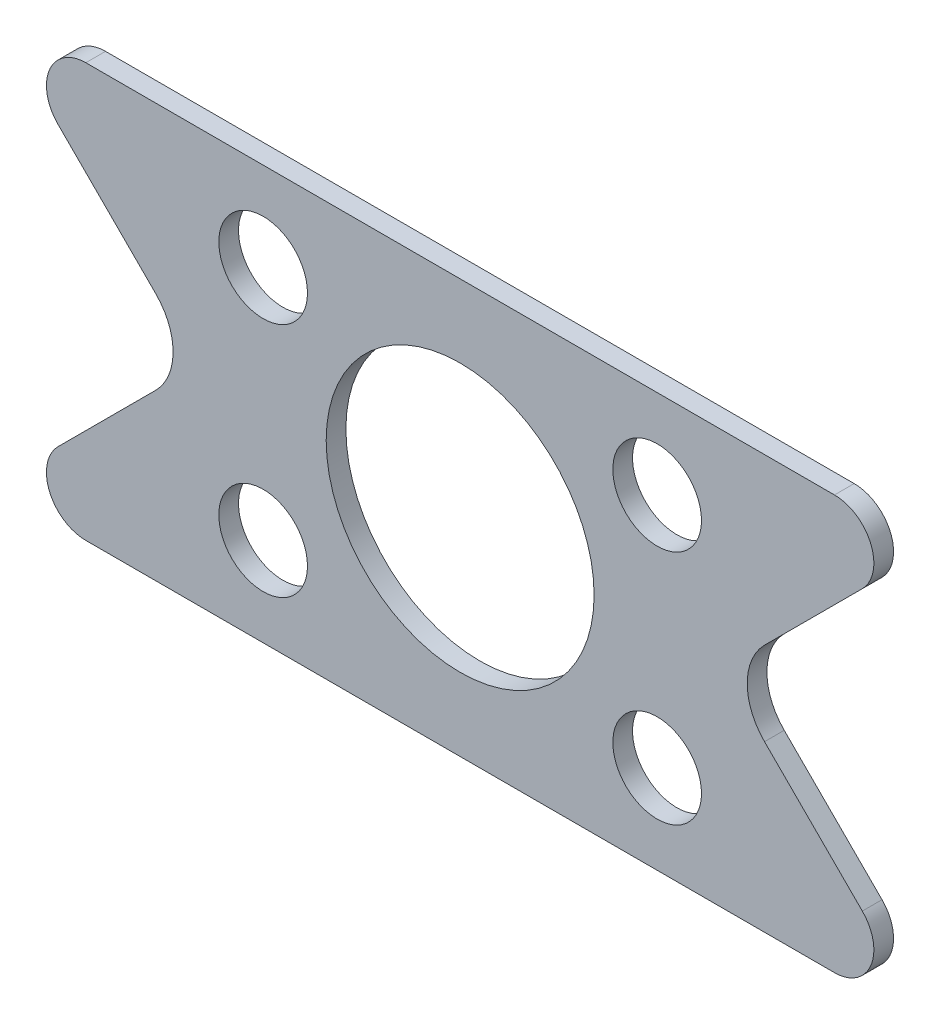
ISO-10303-21;
HEADER;
FILE_DESCRIPTION(('STEP AP214'),'2;1');
FILE_NAME('part.step','',(''),(''),'','','');
FILE_SCHEMA(('AUTOMOTIVE_DESIGN { 1 0 10303 214 1 1 1 1 }'));
ENDSEC;
DATA;
#1=APPLICATION_CONTEXT('core data for automotive mechanical design processes');
#2=APPLICATION_PROTOCOL_DEFINITION('international standard','automotive_design',2000,#1);
#3=PRODUCT_CONTEXT('',#1,'mechanical');
#4=PRODUCT('Part','Part','',(#3));
#5=PRODUCT_RELATED_PRODUCT_CATEGORY('part','',(#4));
#6=PRODUCT_DEFINITION_FORMATION('','',#4);
#7=PRODUCT_DEFINITION_CONTEXT('part definition',#1,'design');
#8=PRODUCT_DEFINITION('design','',#6,#7);
#9=PRODUCT_DEFINITION_SHAPE('','',#8);
#10=(LENGTH_UNIT() NAMED_UNIT(*) SI_UNIT(.MILLI.,.METRE.));
#11=(NAMED_UNIT(*) PLANE_ANGLE_UNIT() SI_UNIT($,.RADIAN.));
#12=(NAMED_UNIT(*) SI_UNIT($,.STERADIAN.) SOLID_ANGLE_UNIT());
#13=UNCERTAINTY_MEASURE_WITH_UNIT(LENGTH_MEASURE(1.E-05),#10,'distance_accuracy_value','');
#14=(GEOMETRIC_REPRESENTATION_CONTEXT(3) GLOBAL_UNCERTAINTY_ASSIGNED_CONTEXT((#13)) GLOBAL_UNIT_ASSIGNED_CONTEXT((#10,
#11,#12)) REPRESENTATION_CONTEXT('',''));
#15=CARTESIAN_POINT('',(0.,0.,0.));
#16=DIRECTION('',(0.,0.,1.));
#17=DIRECTION('',(1.,0.,0.));
#18=AXIS2_PLACEMENT_3D('',#15,#16,#17);
#19=CARTESIAN_POINT('',(-210.,-105.,10.));
#20=DIRECTION('',(0.,1.,0.));
#21=DIRECTION('',(0.,0.,1.));
#22=AXIS2_PLACEMENT_3D('',#19,#20,#21);
#23=PLANE('',#22);
#24=DIRECTION('',(0.,0.,1.));
#25=VECTOR('',#24,1.);
#26=CARTESIAN_POINT('',(-190.,-105.,0.));
#27=LINE('',#26,#25);
#28=CARTESIAN_POINT('',(-190.,-105.,0.));
#29=VERTEX_POINT('',#28);
#30=CARTESIAN_POINT('',(-190.,-105.,10.));
#31=VERTEX_POINT('',#30);
#32=EDGE_CURVE('E162',#29,#31,#27,.T.);
#33=ORIENTED_EDGE('',*,*,#32,.F.);
#34=DIRECTION('',(1.,0.,0.));
#35=VECTOR('',#34,1.);
#36=CARTESIAN_POINT('',(-210.,-105.,0.));
#37=LINE('',#36,#35);
#38=CARTESIAN_POINT('',(190.,-105.,0.));
#39=VERTEX_POINT('',#38);
#40=EDGE_CURVE('E145',#29,#39,#37,.T.);
#41=ORIENTED_EDGE('',*,*,#40,.T.);
#42=DIRECTION('',(0.,0.,1.));
#43=VECTOR('',#42,1.);
#44=CARTESIAN_POINT('',(190.,-105.,0.));
#45=LINE('',#44,#43);
#46=CARTESIAN_POINT('',(190.,-105.,10.));
#47=VERTEX_POINT('',#46);
#48=EDGE_CURVE('E185',#39,#47,#45,.T.);
#49=ORIENTED_EDGE('',*,*,#48,.T.);
#50=DIRECTION('',(1.,0.,0.));
#51=VECTOR('',#50,1.);
#52=CARTESIAN_POINT('',(-210.,-105.,10.));
#53=LINE('',#52,#51);
#54=EDGE_CURVE('E38',#31,#47,#53,.T.);
#55=ORIENTED_EDGE('',*,*,#54,.F.);
#56=EDGE_LOOP('',(#33,#41,#49,#55));
#57=FACE_BOUND('',#56,.T.);
#58=ADVANCED_FACE('F30',(#57),#23,.F.);
#59=CARTESIAN_POINT('',(-210.,-105.,10.));
#60=DIRECTION('',(0.,0.,-1.));
#61=DIRECTION('',(-1.,0.,0.));
#62=AXIS2_PLACEMENT_3D('',#59,#60,#61);
#63=PLANE('',#62);
#64=CARTESIAN_POINT('',(-100.,60.,10.));
#65=DIRECTION('',(0.,0.,1.));
#66=DIRECTION('',(1.,0.,0.));
#67=AXIS2_PLACEMENT_3D('',#64,#65,#66);
#68=CIRCLE('',#67,22.5);
#69=CARTESIAN_POINT('',(-77.5,60.,10.));
#70=VERTEX_POINT('',#69);
#71=EDGE_CURVE('E213',#70,#70,#68,.T.);
#72=ORIENTED_EDGE('',*,*,#71,.F.);
#73=EDGE_LOOP('',(#72));
#74=FACE_BOUND('',#73,.T.);
#75=CARTESIAN_POINT('',(100.,-60.,10.));
#76=DIRECTION('',(0.,0.,1.));
#77=DIRECTION('',(1.,0.,0.));
#78=AXIS2_PLACEMENT_3D('',#75,#76,#77);
#79=CIRCLE('',#78,22.5);
#80=CARTESIAN_POINT('',(122.5,-60.,10.));
#81=VERTEX_POINT('',#80);
#82=EDGE_CURVE('E225',#81,#81,#79,.T.);
#83=ORIENTED_EDGE('',*,*,#82,.F.);
#84=EDGE_LOOP('',(#83));
#85=FACE_BOUND('',#84,.T.);
#86=CARTESIAN_POINT('',(0.,0.,10.));
#87=DIRECTION('',(0.,0.,1.));
#88=DIRECTION('',(1.,0.,0.));
#89=AXIS2_PLACEMENT_3D('',#86,#87,#88);
#90=CIRCLE('',#89,68.);
#91=CARTESIAN_POINT('',(68.,0.,10.));
#92=VERTEX_POINT('',#91);
#93=EDGE_CURVE('E237',#92,#92,#90,.T.);
#94=ORIENTED_EDGE('',*,*,#93,.F.);
#95=EDGE_LOOP('',(#94));
#96=FACE_BOUND('',#95,.T.);
#97=CARTESIAN_POINT('',(100.,60.,10.));
#98=DIRECTION('',(0.,0.,1.));
#99=DIRECTION('',(1.,0.,0.));
#100=AXIS2_PLACEMENT_3D('',#97,#98,#99);
#101=CIRCLE('',#100,22.5);
#102=CARTESIAN_POINT('',(122.5,60.,10.));
#103=VERTEX_POINT('',#102);
#104=EDGE_CURVE('E231',#103,#103,#101,.T.);
#105=ORIENTED_EDGE('',*,*,#104,.F.);
#106=EDGE_LOOP('',(#105));
#107=FACE_BOUND('',#106,.T.);
#108=CARTESIAN_POINT('',(-100.,-60.,10.));
#109=DIRECTION('',(0.,0.,1.));
#110=DIRECTION('',(1.,0.,0.));
#111=AXIS2_PLACEMENT_3D('',#108,#109,#110);
#112=CIRCLE('',#111,22.5);
#113=CARTESIAN_POINT('',(-77.5,-60.,10.));
#114=VERTEX_POINT('',#113);
#115=EDGE_CURVE('E219',#114,#114,#112,.T.);
#116=ORIENTED_EDGE('',*,*,#115,.F.);
#117=EDGE_LOOP('',(#116));
#118=FACE_BOUND('',#117,.T.);
#119=CARTESIAN_POINT('',(-190.,-85.,10.));
#120=DIRECTION('',(0.,0.,1.));
#121=DIRECTION('',(-1.,0.,0.));
#122=AXIS2_PLACEMENT_3D('',#119,#120,#121);
#123=CIRCLE('',#122,19.9999999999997);
#124=CARTESIAN_POINT('',(-204.142135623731,-70.8578643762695,10.));
#125=VERTEX_POINT('',#124);
#126=EDGE_CURVE('E138',#125,#31,#123,.T.);
#127=ORIENTED_EDGE('',*,*,#126,.T.);
#128=ORIENTED_EDGE('',*,*,#54,.T.);
#129=CARTESIAN_POINT('',(190.,-85.,10.));
#130=DIRECTION('',(0.,0.,-1.));
#131=DIRECTION('',(1.,0.,0.));
#132=AXIS2_PLACEMENT_3D('',#129,#130,#131);
#133=CIRCLE('',#132,19.9999999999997);
#134=CARTESIAN_POINT('',(204.142135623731,-70.8578643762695,10.));
#135=VERTEX_POINT('',#134);
#136=EDGE_CURVE('E164',#135,#47,#133,.T.);
#137=ORIENTED_EDGE('',*,*,#136,.F.);
#138=DIRECTION('',(0.707106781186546,-0.707106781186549,0.));
#139=VECTOR('',#138,1.);
#140=CARTESIAN_POINT('',(154.497474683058,-21.2132034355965,10.));
#141=LINE('',#140,#139);
#142=CARTESIAN_POINT('',(154.497474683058,-21.2132034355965,10.));
#143=VERTEX_POINT('',#142);
#144=EDGE_CURVE('E174',#143,#135,#141,.T.);
#145=ORIENTED_EDGE('',*,*,#144,.F.);
#146=CARTESIAN_POINT('',(175.710678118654,-1.43218770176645E-13,10.));
#147=DIRECTION('',(0.,0.,1.));
#148=DIRECTION('',(1.,0.,0.));
#149=AXIS2_PLACEMENT_3D('',#146,#147,#148);
#150=CIRCLE('',#149,30.);
#151=CARTESIAN_POINT('',(154.497474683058,21.2132034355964,10.));
#152=VERTEX_POINT('',#151);
#153=EDGE_CURVE('E193',#152,#143,#150,.T.);
#154=ORIENTED_EDGE('',*,*,#153,.F.);
#155=DIRECTION('',(-0.707106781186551,-0.707106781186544,0.));
#156=VECTOR('',#155,1.);
#157=CARTESIAN_POINT('',(204.142135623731,70.8578643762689,10.));
#158=LINE('',#157,#156);
#159=CARTESIAN_POINT('',(204.142135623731,70.8578643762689,10.));
#160=VERTEX_POINT('',#159);
#161=EDGE_CURVE('E190',#160,#152,#158,.T.);
#162=ORIENTED_EDGE('',*,*,#161,.F.);
#163=CARTESIAN_POINT('',(190.,85.,10.));
#164=DIRECTION('',(0.,0.,-1.));
#165=DIRECTION('',(1.,0.,0.));
#166=AXIS2_PLACEMENT_3D('',#163,#164,#165);
#167=CIRCLE('',#166,20.);
#168=CARTESIAN_POINT('',(190.,105.,10.));
#169=VERTEX_POINT('',#168);
#170=EDGE_CURVE('E188',#169,#160,#167,.T.);
#171=ORIENTED_EDGE('',*,*,#170,.F.);
#172=DIRECTION('',(-1.,0.,0.));
#173=VECTOR('',#172,1.);
#174=CARTESIAN_POINT('',(-210.,105.,10.));
#175=LINE('',#174,#173);
#176=CARTESIAN_POINT('',(-190.,105.,10.));
#177=VERTEX_POINT('',#176);
#178=EDGE_CURVE('E11',#169,#177,#175,.T.);
#179=ORIENTED_EDGE('',*,*,#178,.T.);
#180=CARTESIAN_POINT('',(-190.,85.,10.));
#181=DIRECTION('',(0.,0.,1.));
#182=DIRECTION('',(-1.,0.,0.));
#183=AXIS2_PLACEMENT_3D('',#180,#181,#182);
#184=CIRCLE('',#183,20.);
#185=CARTESIAN_POINT('',(-204.142135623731,70.8578643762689,10.));
#186=VERTEX_POINT('',#185);
#187=EDGE_CURVE('E46',#177,#186,#184,.T.);
#188=ORIENTED_EDGE('',*,*,#187,.T.);
#189=DIRECTION('',(0.707106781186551,-0.707106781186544,0.));
#190=VECTOR('',#189,1.);
#191=CARTESIAN_POINT('',(-204.142135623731,70.8578643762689,10.));
#192=LINE('',#191,#190);
#193=CARTESIAN_POINT('',(-154.497474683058,21.2132034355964,10.));
#194=VERTEX_POINT('',#193);
#195=EDGE_CURVE('E147',#186,#194,#192,.T.);
#196=ORIENTED_EDGE('',*,*,#195,.T.);
#197=CARTESIAN_POINT('',(-175.710678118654,-1.43218770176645E-13,10.));
#198=DIRECTION('',(0.,0.,-1.));
#199=DIRECTION('',(-1.,0.,0.));
#200=AXIS2_PLACEMENT_3D('',#197,#198,#199);
#201=CIRCLE('',#200,30.);
#202=CARTESIAN_POINT('',(-154.497474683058,-21.2132034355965,10.));
#203=VERTEX_POINT('',#202);
#204=EDGE_CURVE('E157',#194,#203,#201,.T.);
#205=ORIENTED_EDGE('',*,*,#204,.T.);
#206=DIRECTION('',(-0.707106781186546,-0.707106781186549,0.));
#207=VECTOR('',#206,1.);
#208=CARTESIAN_POINT('',(-154.497474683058,-21.2132034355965,10.));
#209=LINE('',#208,#207);
#210=EDGE_CURVE('E155',#203,#125,#209,.T.);
#211=ORIENTED_EDGE('',*,*,#210,.T.);
#212=EDGE_LOOP('',(#127,#128,#137,#145,#154,#162,#171,#179,#188,#196,#205,#211));
#213=FACE_BOUND('',#212,.T.);
#214=ADVANCED_FACE('F259',(#74,#85,#96,#107,#118,#213),#63,.F.);
#215=CARTESIAN_POINT('',(-210.,-105.,0.));
#216=DIRECTION('',(0.,0.,-1.));
#217=DIRECTION('',(-1.,0.,0.));
#218=AXIS2_PLACEMENT_3D('',#215,#216,#217);
#219=PLANE('',#218);
#220=CARTESIAN_POINT('',(-100.,60.,0.));
#221=DIRECTION('',(0.,0.,1.));
#222=DIRECTION('',(1.,0.,0.));
#223=AXIS2_PLACEMENT_3D('',#220,#221,#222);
#224=CIRCLE('',#223,22.5);
#225=CARTESIAN_POINT('',(-77.5,60.,0.));
#226=VERTEX_POINT('',#225);
#227=EDGE_CURVE('E201',#226,#226,#224,.T.);
#228=ORIENTED_EDGE('',*,*,#227,.T.);
#229=EDGE_LOOP('',(#228));
#230=FACE_BOUND('',#229,.T.);
#231=CARTESIAN_POINT('',(100.,-60.,0.));
#232=DIRECTION('',(0.,0.,1.));
#233=DIRECTION('',(1.,0.,0.));
#234=AXIS2_PLACEMENT_3D('',#231,#232,#233);
#235=CIRCLE('',#234,22.5);
#236=CARTESIAN_POINT('',(122.5,-60.,0.));
#237=VERTEX_POINT('',#236);
#238=EDGE_CURVE('E222',#237,#237,#235,.T.);
#239=ORIENTED_EDGE('',*,*,#238,.T.);
#240=EDGE_LOOP('',(#239));
#241=FACE_BOUND('',#240,.T.);
#242=CARTESIAN_POINT('',(0.,0.,0.));
#243=DIRECTION('',(0.,0.,1.));
#244=DIRECTION('',(1.,0.,0.));
#245=AXIS2_PLACEMENT_3D('',#242,#243,#244);
#246=CIRCLE('',#245,68.);
#247=CARTESIAN_POINT('',(68.,0.,0.));
#248=VERTEX_POINT('',#247);
#249=EDGE_CURVE('E234',#248,#248,#246,.T.);
#250=ORIENTED_EDGE('',*,*,#249,.T.);
#251=EDGE_LOOP('',(#250));
#252=FACE_BOUND('',#251,.T.);
#253=CARTESIAN_POINT('',(100.,60.,0.));
#254=DIRECTION('',(0.,0.,1.));
#255=DIRECTION('',(1.,0.,0.));
#256=AXIS2_PLACEMENT_3D('',#253,#254,#255);
#257=CIRCLE('',#256,22.5);
#258=CARTESIAN_POINT('',(122.5,60.,0.));
#259=VERTEX_POINT('',#258);
#260=EDGE_CURVE('E228',#259,#259,#257,.T.);
#261=ORIENTED_EDGE('',*,*,#260,.T.);
#262=EDGE_LOOP('',(#261));
#263=FACE_BOUND('',#262,.T.);
#264=CARTESIAN_POINT('',(-100.,-60.,0.));
#265=DIRECTION('',(0.,0.,1.));
#266=DIRECTION('',(1.,0.,0.));
#267=AXIS2_PLACEMENT_3D('',#264,#265,#266);
#268=CIRCLE('',#267,22.5);
#269=CARTESIAN_POINT('',(-77.5,-60.,0.));
#270=VERTEX_POINT('',#269);
#271=EDGE_CURVE('E216',#270,#270,#268,.T.);
#272=ORIENTED_EDGE('',*,*,#271,.T.);
#273=EDGE_LOOP('',(#272));
#274=FACE_BOUND('',#273,.T.);
#275=ORIENTED_EDGE('',*,*,#40,.F.);
#276=CARTESIAN_POINT('',(-190.,-85.,0.));
#277=DIRECTION('',(0.,0.,1.));
#278=DIRECTION('',(-1.,0.,0.));
#279=AXIS2_PLACEMENT_3D('',#276,#277,#278);
#280=CIRCLE('',#279,19.9999999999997);
#281=CARTESIAN_POINT('',(-204.142135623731,-70.8578643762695,0.));
#282=VERTEX_POINT('',#281);
#283=EDGE_CURVE('E132',#282,#29,#280,.T.);
#284=ORIENTED_EDGE('',*,*,#283,.F.);
#285=DIRECTION('',(-0.707106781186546,-0.707106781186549,0.));
#286=VECTOR('',#285,1.);
#287=CARTESIAN_POINT('',(-154.497474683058,-21.2132034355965,0.));
#288=LINE('',#287,#286);
#289=CARTESIAN_POINT('',(-154.497474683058,-21.2132034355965,0.));
#290=VERTEX_POINT('',#289);
#291=EDGE_CURVE('E121',#290,#282,#288,.T.);
#292=ORIENTED_EDGE('',*,*,#291,.F.);
#293=CARTESIAN_POINT('',(-175.710678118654,-1.43218770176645E-13,0.));
#294=DIRECTION('',(0.,0.,-1.));
#295=DIRECTION('',(-1.,0.,0.));
#296=AXIS2_PLACEMENT_3D('',#293,#294,#295);
#297=CIRCLE('',#296,30.);
#298=CARTESIAN_POINT('',(-154.497474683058,21.2132034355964,0.));
#299=VERTEX_POINT('',#298);
#300=EDGE_CURVE('E131',#299,#290,#297,.T.);
#301=ORIENTED_EDGE('',*,*,#300,.F.);
#302=DIRECTION('',(0.707106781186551,-0.707106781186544,0.));
#303=VECTOR('',#302,1.);
#304=CARTESIAN_POINT('',(-204.142135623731,70.8578643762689,0.));
#305=LINE('',#304,#303);
#306=CARTESIAN_POINT('',(-204.142135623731,70.8578643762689,0.));
#307=VERTEX_POINT('',#306);
#308=EDGE_CURVE('E151',#307,#299,#305,.T.);
#309=ORIENTED_EDGE('',*,*,#308,.F.);
#310=CARTESIAN_POINT('',(-190.,85.,0.));
#311=DIRECTION('',(0.,0.,1.));
#312=DIRECTION('',(-1.,0.,0.));
#313=AXIS2_PLACEMENT_3D('',#310,#311,#312);
#314=CIRCLE('',#313,20.);
#315=CARTESIAN_POINT('',(-190.,105.,0.));
#316=VERTEX_POINT('',#315);
#317=EDGE_CURVE('E140',#316,#307,#314,.T.);
#318=ORIENTED_EDGE('',*,*,#317,.F.);
#319=DIRECTION('',(-1.,0.,0.));
#320=VECTOR('',#319,1.);
#321=CARTESIAN_POINT('',(-210.,105.,0.));
#322=LINE('',#321,#320);
#323=CARTESIAN_POINT('',(190.,105.,0.));
#324=VERTEX_POINT('',#323);
#325=EDGE_CURVE('E33',#324,#316,#322,.T.);
#326=ORIENTED_EDGE('',*,*,#325,.F.);
#327=CARTESIAN_POINT('',(190.,85.,0.));
#328=DIRECTION('',(0.,0.,-1.));
#329=DIRECTION('',(1.,0.,0.));
#330=AXIS2_PLACEMENT_3D('',#327,#328,#329);
#331=CIRCLE('',#330,20.);
#332=CARTESIAN_POINT('',(204.142135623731,70.8578643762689,0.));
#333=VERTEX_POINT('',#332);
#334=EDGE_CURVE('E54',#324,#333,#331,.T.);
#335=ORIENTED_EDGE('',*,*,#334,.T.);
#336=DIRECTION('',(-0.707106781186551,-0.707106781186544,0.));
#337=VECTOR('',#336,1.);
#338=CARTESIAN_POINT('',(204.142135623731,70.8578643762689,0.));
#339=LINE('',#338,#337);
#340=CARTESIAN_POINT('',(154.497474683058,21.2132034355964,0.));
#341=VERTEX_POINT('',#340);
#342=EDGE_CURVE('E176',#333,#341,#339,.T.);
#343=ORIENTED_EDGE('',*,*,#342,.T.);
#344=CARTESIAN_POINT('',(175.710678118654,-1.43218770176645E-13,0.));
#345=DIRECTION('',(0.,0.,1.));
#346=DIRECTION('',(1.,0.,0.));
#347=AXIS2_PLACEMENT_3D('',#344,#345,#346);
#348=CIRCLE('',#347,30.);
#349=CARTESIAN_POINT('',(154.497474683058,-21.2132034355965,0.));
#350=VERTEX_POINT('',#349);
#351=EDGE_CURVE('E179',#341,#350,#348,.T.);
#352=ORIENTED_EDGE('',*,*,#351,.T.);
#353=DIRECTION('',(0.707106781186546,-0.707106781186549,0.));
#354=VECTOR('',#353,1.);
#355=CARTESIAN_POINT('',(154.497474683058,-21.2132034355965,0.));
#356=LINE('',#355,#354);
#357=CARTESIAN_POINT('',(204.142135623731,-70.8578643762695,0.));
#358=VERTEX_POINT('',#357);
#359=EDGE_CURVE('E182',#350,#358,#356,.T.);
#360=ORIENTED_EDGE('',*,*,#359,.T.);
#361=CARTESIAN_POINT('',(190.,-85.,0.));
#362=DIRECTION('',(0.,0.,-1.));
#363=DIRECTION('',(1.,0.,0.));
#364=AXIS2_PLACEMENT_3D('',#361,#362,#363);
#365=CIRCLE('',#364,19.9999999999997);
#366=EDGE_CURVE('E172',#358,#39,#365,.T.);
#367=ORIENTED_EDGE('',*,*,#366,.T.);
#368=EDGE_LOOP('',(#275,#284,#292,#301,#309,#318,#326,#335,#343,#352,#360,#367));
#369=FACE_BOUND('',#368,.T.);
#370=ADVANCED_FACE('F143',(#230,#241,#252,#263,#274,#369),#219,.T.);
#371=CARTESIAN_POINT('',(-210.,105.,10.));
#372=DIRECTION('',(0.,-1.,0.));
#373=DIRECTION('',(1.,0.,0.));
#374=AXIS2_PLACEMENT_3D('',#371,#372,#373);
#375=PLANE('',#374);
#376=ORIENTED_EDGE('',*,*,#325,.T.);
#377=DIRECTION('',(0.,0.,1.));
#378=VECTOR('',#377,1.);
#379=CARTESIAN_POINT('',(-190.,105.,0.));
#380=LINE('',#379,#378);
#381=EDGE_CURVE('E165',#316,#177,#380,.T.);
#382=ORIENTED_EDGE('',*,*,#381,.T.);
#383=ORIENTED_EDGE('',*,*,#178,.F.);
#384=DIRECTION('',(0.,0.,1.));
#385=VECTOR('',#384,1.);
#386=CARTESIAN_POINT('',(190.,105.,0.));
#387=LINE('',#386,#385);
#388=EDGE_CURVE('E209',#324,#169,#387,.T.);
#389=ORIENTED_EDGE('',*,*,#388,.F.);
#390=EDGE_LOOP('',(#376,#382,#383,#389));
#391=FACE_BOUND('',#390,.T.);
#392=ADVANCED_FACE('F247',(#391),#375,.F.);
#393=CARTESIAN_POINT('',(0.,0.,10.));
#394=DIRECTION('',(0.,0.,-1.));
#395=DIRECTION('',(-1.,0.,0.));
#396=AXIS2_PLACEMENT_3D('',#393,#394,#395);
#397=CYLINDRICAL_SURFACE('',#396,68.);
#398=ORIENTED_EDGE('',*,*,#93,.T.);
#399=EDGE_LOOP('',(#398));
#400=FACE_BOUND('',#399,.T.);
#401=ORIENTED_EDGE('',*,*,#249,.F.);
#402=EDGE_LOOP('',(#401));
#403=FACE_BOUND('',#402,.T.);
#404=ADVANCED_FACE('F414',(#400,#403),#397,.F.);
#405=CARTESIAN_POINT('',(100.,60.,10.));
#406=DIRECTION('',(0.,0.,-1.));
#407=DIRECTION('',(-1.,0.,0.));
#408=AXIS2_PLACEMENT_3D('',#405,#406,#407);
#409=CYLINDRICAL_SURFACE('',#408,22.5);
#410=ORIENTED_EDGE('',*,*,#104,.T.);
#411=EDGE_LOOP('',(#410));
#412=FACE_BOUND('',#411,.T.);
#413=ORIENTED_EDGE('',*,*,#260,.F.);
#414=EDGE_LOOP('',(#413));
#415=FACE_BOUND('',#414,.T.);
#416=ADVANCED_FACE('F405',(#412,#415),#409,.F.);
#417=CARTESIAN_POINT('',(100.,-60.,10.));
#418=DIRECTION('',(0.,0.,-1.));
#419=DIRECTION('',(-1.,0.,0.));
#420=AXIS2_PLACEMENT_3D('',#417,#418,#419);
#421=CYLINDRICAL_SURFACE('',#420,22.5);
#422=ORIENTED_EDGE('',*,*,#82,.T.);
#423=EDGE_LOOP('',(#422));
#424=FACE_BOUND('',#423,.T.);
#425=ORIENTED_EDGE('',*,*,#238,.F.);
#426=EDGE_LOOP('',(#425));
#427=FACE_BOUND('',#426,.T.);
#428=ADVANCED_FACE('F396',(#424,#427),#421,.F.);
#429=CARTESIAN_POINT('',(-100.,-60.,10.));
#430=DIRECTION('',(0.,0.,-1.));
#431=DIRECTION('',(-1.,0.,0.));
#432=AXIS2_PLACEMENT_3D('',#429,#430,#431);
#433=CYLINDRICAL_SURFACE('',#432,22.5);
#434=ORIENTED_EDGE('',*,*,#115,.T.);
#435=EDGE_LOOP('',(#434));
#436=FACE_BOUND('',#435,.T.);
#437=ORIENTED_EDGE('',*,*,#271,.F.);
#438=EDGE_LOOP('',(#437));
#439=FACE_BOUND('',#438,.T.);
#440=ADVANCED_FACE('F387',(#436,#439),#433,.F.);
#441=CARTESIAN_POINT('',(-100.,60.,10.));
#442=DIRECTION('',(0.,0.,-1.));
#443=DIRECTION('',(-1.,0.,0.));
#444=AXIS2_PLACEMENT_3D('',#441,#442,#443);
#445=CYLINDRICAL_SURFACE('',#444,22.5);
#446=ORIENTED_EDGE('',*,*,#71,.T.);
#447=EDGE_LOOP('',(#446));
#448=FACE_BOUND('',#447,.T.);
#449=ORIENTED_EDGE('',*,*,#227,.F.);
#450=EDGE_LOOP('',(#449));
#451=FACE_BOUND('',#450,.T.);
#452=ADVANCED_FACE('F274',(#448,#451),#445,.F.);
#453=CARTESIAN_POINT('',(190.,-85.,0.));
#454=DIRECTION('',(0.,0.,1.));
#455=DIRECTION('',(1.,0.,0.));
#456=AXIS2_PLACEMENT_3D('',#453,#454,#455);
#457=CYLINDRICAL_SURFACE('',#456,19.9999999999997);
#458=ORIENTED_EDGE('',*,*,#136,.T.);
#459=ORIENTED_EDGE('',*,*,#48,.F.);
#460=ORIENTED_EDGE('',*,*,#366,.F.);
#461=DIRECTION('',(0.,0.,1.));
#462=VECTOR('',#461,1.);
#463=CARTESIAN_POINT('',(204.142135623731,-70.8578643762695,0.));
#464=LINE('',#463,#462);
#465=EDGE_CURVE('E198',#358,#135,#464,.T.);
#466=ORIENTED_EDGE('',*,*,#465,.T.);
#467=EDGE_LOOP('',(#458,#459,#460,#466));
#468=FACE_BOUND('',#467,.T.);
#469=ADVANCED_FACE('F265',(#468),#457,.T.);
#470=CARTESIAN_POINT('',(190.,85.,0.));
#471=DIRECTION('',(0.,0.,1.));
#472=DIRECTION('',(1.,0.,0.));
#473=AXIS2_PLACEMENT_3D('',#470,#471,#472);
#474=CYLINDRICAL_SURFACE('',#473,20.);
#475=ORIENTED_EDGE('',*,*,#170,.T.);
#476=DIRECTION('',(0.,0.,1.));
#477=VECTOR('',#476,1.);
#478=CARTESIAN_POINT('',(204.142135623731,70.8578643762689,0.));
#479=LINE('',#478,#477);
#480=EDGE_CURVE('E206',#333,#160,#479,.T.);
#481=ORIENTED_EDGE('',*,*,#480,.F.);
#482=ORIENTED_EDGE('',*,*,#334,.F.);
#483=ORIENTED_EDGE('',*,*,#388,.T.);
#484=EDGE_LOOP('',(#475,#481,#482,#483));
#485=FACE_BOUND('',#484,.T.);
#486=ADVANCED_FACE('F262',(#485),#474,.T.);
#487=CARTESIAN_POINT('',(154.497474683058,-21.2132034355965,0.));
#488=DIRECTION('',(-0.707106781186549,-0.707106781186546,0.));
#489=DIRECTION('',(0.707106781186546,-0.707106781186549,0.));
#490=AXIS2_PLACEMENT_3D('',#487,#488,#489);
#491=PLANE('',#490);
#492=ORIENTED_EDGE('',*,*,#144,.T.);
#493=ORIENTED_EDGE('',*,*,#465,.F.);
#494=ORIENTED_EDGE('',*,*,#359,.F.);
#495=DIRECTION('',(0.,0.,1.));
#496=VECTOR('',#495,1.);
#497=CARTESIAN_POINT('',(154.497474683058,-21.2132034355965,0.));
#498=LINE('',#497,#496);
#499=EDGE_CURVE('E202',#350,#143,#498,.T.);
#500=ORIENTED_EDGE('',*,*,#499,.T.);
#501=EDGE_LOOP('',(#492,#493,#494,#500));
#502=FACE_BOUND('',#501,.T.);
#503=ADVANCED_FACE('F264',(#502),#491,.F.);
#504=CARTESIAN_POINT('',(175.710678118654,-1.43218770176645E-13,0.));
#505=DIRECTION('',(0.,0.,1.));
#506=DIRECTION('',(1.,0.,0.));
#507=AXIS2_PLACEMENT_3D('',#504,#505,#506);
#508=CYLINDRICAL_SURFACE('',#507,30.);
#509=ORIENTED_EDGE('',*,*,#153,.T.);
#510=ORIENTED_EDGE('',*,*,#499,.F.);
#511=ORIENTED_EDGE('',*,*,#351,.F.);
#512=DIRECTION('',(0.,0.,1.));
#513=VECTOR('',#512,1.);
#514=CARTESIAN_POINT('',(154.497474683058,21.2132034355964,0.));
#515=LINE('',#514,#513);
#516=EDGE_CURVE('E204',#341,#152,#515,.T.);
#517=ORIENTED_EDGE('',*,*,#516,.T.);
#518=EDGE_LOOP('',(#509,#510,#511,#517));
#519=FACE_BOUND('',#518,.T.);
#520=ADVANCED_FACE('F271',(#519),#508,.F.);
#521=CARTESIAN_POINT('',(204.142135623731,70.8578643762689,0.));
#522=DIRECTION('',(-0.707106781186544,0.707106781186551,0.));
#523=DIRECTION('',(-0.707106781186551,-0.707106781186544,0.));
#524=AXIS2_PLACEMENT_3D('',#521,#522,#523);
#525=PLANE('',#524);
#526=ORIENTED_EDGE('',*,*,#161,.T.);
#527=ORIENTED_EDGE('',*,*,#516,.F.);
#528=ORIENTED_EDGE('',*,*,#342,.F.);
#529=ORIENTED_EDGE('',*,*,#480,.T.);
#530=EDGE_LOOP('',(#526,#527,#528,#529));
#531=FACE_BOUND('',#530,.T.);
#532=ADVANCED_FACE('F292',(#531),#525,.F.);
#533=CARTESIAN_POINT('',(-190.,-85.,0.));
#534=DIRECTION('',(0.,0.,1.));
#535=DIRECTION('',(1.,0.,0.));
#536=AXIS2_PLACEMENT_3D('',#533,#534,#535);
#537=CYLINDRICAL_SURFACE('',#536,19.9999999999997);
#538=ORIENTED_EDGE('',*,*,#283,.T.);
#539=ORIENTED_EDGE('',*,*,#32,.T.);
#540=ORIENTED_EDGE('',*,*,#126,.F.);
#541=DIRECTION('',(0.,0.,1.));
#542=VECTOR('',#541,1.);
#543=CARTESIAN_POINT('',(-204.142135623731,-70.8578643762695,0.));
#544=LINE('',#543,#542);
#545=EDGE_CURVE('E125',#282,#125,#544,.T.);
#546=ORIENTED_EDGE('',*,*,#545,.F.);
#547=EDGE_LOOP('',(#538,#539,#540,#546));
#548=FACE_BOUND('',#547,.T.);
#549=ADVANCED_FACE('F135',(#548),#537,.T.);
#550=CARTESIAN_POINT('',(-190.,85.,0.));
#551=DIRECTION('',(0.,0.,1.));
#552=DIRECTION('',(1.,0.,0.));
#553=AXIS2_PLACEMENT_3D('',#550,#551,#552);
#554=CYLINDRICAL_SURFACE('',#553,20.);
#555=ORIENTED_EDGE('',*,*,#317,.T.);
#556=DIRECTION('',(0.,0.,1.));
#557=VECTOR('',#556,1.);
#558=CARTESIAN_POINT('',(-204.142135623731,70.8578643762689,0.));
#559=LINE('',#558,#557);
#560=EDGE_CURVE('E167',#307,#186,#559,.T.);
#561=ORIENTED_EDGE('',*,*,#560,.T.);
#562=ORIENTED_EDGE('',*,*,#187,.F.);
#563=ORIENTED_EDGE('',*,*,#381,.F.);
#564=EDGE_LOOP('',(#555,#561,#562,#563));
#565=FACE_BOUND('',#564,.T.);
#566=ADVANCED_FACE('F252',(#565),#554,.T.);
#567=CARTESIAN_POINT('',(-204.142135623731,70.8578643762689,0.));
#568=DIRECTION('',(-0.707106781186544,-0.707106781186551,0.));
#569=DIRECTION('',(0.707106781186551,-0.707106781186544,0.));
#570=AXIS2_PLACEMENT_3D('',#567,#568,#569);
#571=PLANE('',#570);
#572=ORIENTED_EDGE('',*,*,#195,.F.);
#573=ORIENTED_EDGE('',*,*,#560,.F.);
#574=ORIENTED_EDGE('',*,*,#308,.T.);
#575=DIRECTION('',(0.,0.,1.));
#576=VECTOR('',#575,1.);
#577=CARTESIAN_POINT('',(-154.497474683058,21.2132034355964,0.));
#578=LINE('',#577,#576);
#579=EDGE_CURVE('E169',#299,#194,#578,.T.);
#580=ORIENTED_EDGE('',*,*,#579,.T.);
#581=EDGE_LOOP('',(#572,#573,#574,#580));
#582=FACE_BOUND('',#581,.T.);
#583=ADVANCED_FACE('F255',(#582),#571,.T.);
#584=CARTESIAN_POINT('',(-175.710678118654,-1.43218770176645E-13,0.));
#585=DIRECTION('',(0.,0.,1.));
#586=DIRECTION('',(1.,0.,0.));
#587=AXIS2_PLACEMENT_3D('',#584,#585,#586);
#588=CYLINDRICAL_SURFACE('',#587,30.);
#589=ORIENTED_EDGE('',*,*,#204,.F.);
#590=ORIENTED_EDGE('',*,*,#579,.F.);
#591=ORIENTED_EDGE('',*,*,#300,.T.);
#592=DIRECTION('',(0.,0.,1.));
#593=VECTOR('',#592,1.);
#594=CARTESIAN_POINT('',(-154.497474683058,-21.2132034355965,0.));
#595=LINE('',#594,#593);
#596=EDGE_CURVE('E127',#290,#203,#595,.T.);
#597=ORIENTED_EDGE('',*,*,#596,.T.);
#598=EDGE_LOOP('',(#589,#590,#591,#597));
#599=FACE_BOUND('',#598,.T.);
#600=ADVANCED_FACE('F303',(#599),#588,.F.);
#601=CARTESIAN_POINT('',(-154.497474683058,-21.2132034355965,0.));
#602=DIRECTION('',(-0.707106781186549,0.707106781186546,0.));
#603=DIRECTION('',(-0.707106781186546,-0.707106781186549,0.));
#604=AXIS2_PLACEMENT_3D('',#601,#602,#603);
#605=PLANE('',#604);
#606=ORIENTED_EDGE('',*,*,#210,.F.);
#607=ORIENTED_EDGE('',*,*,#596,.F.);
#608=ORIENTED_EDGE('',*,*,#291,.T.);
#609=ORIENTED_EDGE('',*,*,#545,.T.);
#610=EDGE_LOOP('',(#606,#607,#608,#609));
#611=FACE_BOUND('',#610,.T.);
#612=ADVANCED_FACE('F124',(#611),#605,.T.);
#613=CLOSED_SHELL('',(#58,#214,#370,#392,#404,#416,#428,#440,#452,#469,#486,#503,#520,#532,#549,
#566,#583,#600,#612));
#614=MANIFOLD_SOLID_BREP('B2',#613);
#615=ADVANCED_BREP_SHAPE_REPRESENTATION('',(#18,#614),#14);
#616=SHAPE_DEFINITION_REPRESENTATION(#9,#615);
ENDSEC;
END-ISO-10303-21;
